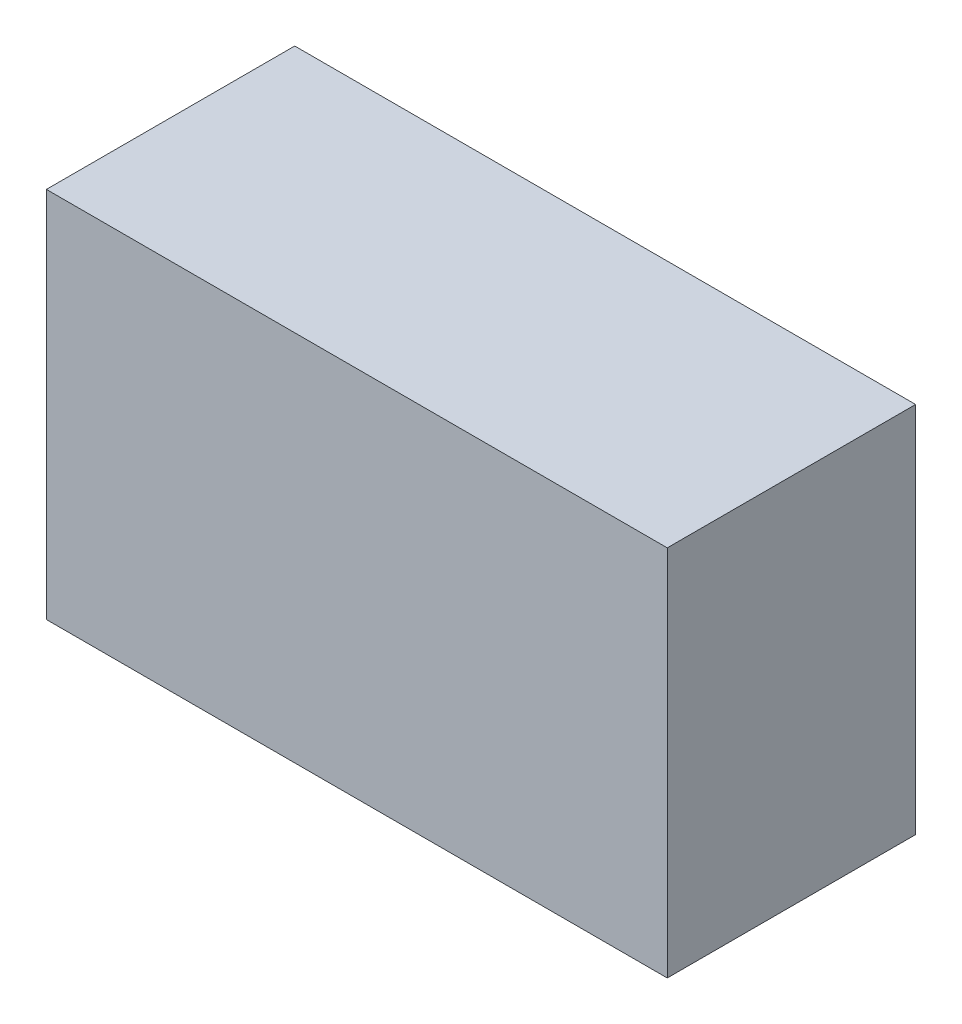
ISO-10303-21;
HEADER;
FILE_DESCRIPTION(('STEP AP214'),'2;1');
FILE_NAME('part.step','',(''),(''),'','','');
FILE_SCHEMA(('AUTOMOTIVE_DESIGN { 1 0 10303 214 1 1 1 1 }'));
ENDSEC;
DATA;
#1=APPLICATION_CONTEXT('core data for automotive mechanical design processes');
#2=APPLICATION_PROTOCOL_DEFINITION('international standard','automotive_design',2000,#1);
#3=PRODUCT_CONTEXT('',#1,'mechanical');
#4=PRODUCT('Part','Part','',(#3));
#5=PRODUCT_RELATED_PRODUCT_CATEGORY('part','',(#4));
#6=PRODUCT_DEFINITION_FORMATION('','',#4);
#7=PRODUCT_DEFINITION_CONTEXT('part definition',#1,'design');
#8=PRODUCT_DEFINITION('design','',#6,#7);
#9=PRODUCT_DEFINITION_SHAPE('','',#8);
#10=(LENGTH_UNIT() NAMED_UNIT(*) SI_UNIT(.MILLI.,.METRE.));
#11=(NAMED_UNIT(*) PLANE_ANGLE_UNIT() SI_UNIT($,.RADIAN.));
#12=(NAMED_UNIT(*) SI_UNIT($,.STERADIAN.) SOLID_ANGLE_UNIT());
#13=UNCERTAINTY_MEASURE_WITH_UNIT(LENGTH_MEASURE(1.E-05),#10,'distance_accuracy_value','');
#14=(GEOMETRIC_REPRESENTATION_CONTEXT(3) GLOBAL_UNCERTAINTY_ASSIGNED_CONTEXT((#13)) GLOBAL_UNIT_ASSIGNED_CONTEXT((#10,
#11,#12)) REPRESENTATION_CONTEXT('',''));
#15=CARTESIAN_POINT('',(0.,0.,0.));
#16=DIRECTION('',(0.,0.,1.));
#17=DIRECTION('',(1.,0.,0.));
#18=AXIS2_PLACEMENT_3D('',#15,#16,#17);
#19=CARTESIAN_POINT('',(63.5000000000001,-19.05,25.4));
#20=DIRECTION('',(0.,1.,0.));
#21=DIRECTION('',(0.,0.,1.));
#22=AXIS2_PLACEMENT_3D('',#19,#20,#21);
#23=PLANE('',#22);
#24=DIRECTION('',(0.,0.,-1.));
#25=VECTOR('',#24,1.);
#26=CARTESIAN_POINT('',(0.,-19.05,25.4));
#27=LINE('',#26,#25);
#28=CARTESIAN_POINT('',(0.,-19.05,25.4));
#29=VERTEX_POINT('',#28);
#30=CARTESIAN_POINT('',(0.,-19.05,0.));
#31=VERTEX_POINT('',#30);
#32=EDGE_CURVE('E115',#29,#31,#27,.T.);
#33=ORIENTED_EDGE('',*,*,#32,.T.);
#34=DIRECTION('',(-1.,0.,0.));
#35=VECTOR('',#34,1.);
#36=CARTESIAN_POINT('',(63.5000000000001,-19.05,0.));
#37=LINE('',#36,#35);
#38=CARTESIAN_POINT('',(63.5000000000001,-19.05,0.));
#39=VERTEX_POINT('',#38);
#40=EDGE_CURVE('E11',#39,#31,#37,.T.);
#41=ORIENTED_EDGE('',*,*,#40,.F.);
#42=DIRECTION('',(0.,0.,-1.));
#43=VECTOR('',#42,1.);
#44=CARTESIAN_POINT('',(63.5000000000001,-19.05,25.4));
#45=LINE('',#44,#43);
#46=CARTESIAN_POINT('',(63.5000000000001,-19.05,25.4));
#47=VERTEX_POINT('',#46);
#48=EDGE_CURVE('E94',#47,#39,#45,.T.);
#49=ORIENTED_EDGE('',*,*,#48,.F.);
#50=DIRECTION('',(-1.,0.,0.));
#51=VECTOR('',#50,1.);
#52=CARTESIAN_POINT('',(63.5000000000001,-19.05,25.4));
#53=LINE('',#52,#51);
#54=EDGE_CURVE('E106',#47,#29,#53,.T.);
#55=ORIENTED_EDGE('',*,*,#54,.T.);
#56=EDGE_LOOP('',(#33,#41,#49,#55));
#57=FACE_BOUND('',#56,.T.);
#58=ADVANCED_FACE('F43',(#57),#23,.F.);
#59=CARTESIAN_POINT('',(63.5000000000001,-19.05,0.));
#60=DIRECTION('',(0.,0.,1.));
#61=DIRECTION('',(1.,0.,0.));
#62=AXIS2_PLACEMENT_3D('',#59,#60,#61);
#63=PLANE('',#62);
#64=DIRECTION('',(0.,1.,0.));
#65=VECTOR('',#64,1.);
#66=CARTESIAN_POINT('',(0.,-19.05,0.));
#67=LINE('',#66,#65);
#68=CARTESIAN_POINT('',(0.,19.05,0.));
#69=VERTEX_POINT('',#68);
#70=EDGE_CURVE('E99',#31,#69,#67,.T.);
#71=ORIENTED_EDGE('',*,*,#70,.T.);
#72=DIRECTION('',(-1.,0.,0.));
#73=VECTOR('',#72,1.);
#74=CARTESIAN_POINT('',(63.5000000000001,19.05,0.));
#75=LINE('',#74,#73);
#76=CARTESIAN_POINT('',(63.5000000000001,19.05,0.));
#77=VERTEX_POINT('',#76);
#78=EDGE_CURVE('E55',#77,#69,#75,.T.);
#79=ORIENTED_EDGE('',*,*,#78,.F.);
#80=DIRECTION('',(0.,1.,0.));
#81=VECTOR('',#80,1.);
#82=CARTESIAN_POINT('',(63.5000000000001,-19.05,0.));
#83=LINE('',#82,#81);
#84=EDGE_CURVE('E89',#39,#77,#83,.T.);
#85=ORIENTED_EDGE('',*,*,#84,.F.);
#86=ORIENTED_EDGE('',*,*,#40,.T.);
#87=EDGE_LOOP('',(#71,#79,#85,#86));
#88=FACE_BOUND('',#87,.T.);
#89=ADVANCED_FACE('F98',(#88),#63,.F.);
#90=CARTESIAN_POINT('',(63.5000000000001,19.05,0.));
#91=DIRECTION('',(0.,-1.,0.));
#92=DIRECTION('',(0.,0.,-1.));
#93=AXIS2_PLACEMENT_3D('',#90,#91,#92);
#94=PLANE('',#93);
#95=DIRECTION('',(0.,0.,1.));
#96=VECTOR('',#95,1.);
#97=CARTESIAN_POINT('',(0.,19.05,0.));
#98=LINE('',#97,#96);
#99=CARTESIAN_POINT('',(0.,19.05,25.4));
#100=VERTEX_POINT('',#99);
#101=EDGE_CURVE('E77',#69,#100,#98,.T.);
#102=ORIENTED_EDGE('',*,*,#101,.T.);
#103=DIRECTION('',(-1.,0.,0.));
#104=VECTOR('',#103,1.);
#105=CARTESIAN_POINT('',(63.5000000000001,19.05,25.4));
#106=LINE('',#105,#104);
#107=CARTESIAN_POINT('',(63.5000000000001,19.05,25.4));
#108=VERTEX_POINT('',#107);
#109=EDGE_CURVE('E105',#108,#100,#106,.T.);
#110=ORIENTED_EDGE('',*,*,#109,.F.);
#111=DIRECTION('',(0.,0.,1.));
#112=VECTOR('',#111,1.);
#113=CARTESIAN_POINT('',(63.5000000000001,19.05,0.));
#114=LINE('',#113,#112);
#115=EDGE_CURVE('E93',#77,#108,#114,.T.);
#116=ORIENTED_EDGE('',*,*,#115,.F.);
#117=ORIENTED_EDGE('',*,*,#78,.T.);
#118=EDGE_LOOP('',(#102,#110,#116,#117));
#119=FACE_BOUND('',#118,.T.);
#120=ADVANCED_FACE('F104',(#119),#94,.F.);
#121=CARTESIAN_POINT('',(63.5000000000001,19.05,25.4));
#122=DIRECTION('',(0.,0.,-1.));
#123=DIRECTION('',(-1.,0.,0.));
#124=AXIS2_PLACEMENT_3D('',#121,#122,#123);
#125=PLANE('',#124);
#126=DIRECTION('',(0.,-1.,0.));
#127=VECTOR('',#126,1.);
#128=CARTESIAN_POINT('',(0.,19.05,25.4));
#129=LINE('',#128,#127);
#130=EDGE_CURVE('E81',#100,#29,#129,.T.);
#131=ORIENTED_EDGE('',*,*,#130,.T.);
#132=ORIENTED_EDGE('',*,*,#54,.F.);
#133=DIRECTION('',(0.,-1.,0.));
#134=VECTOR('',#133,1.);
#135=CARTESIAN_POINT('',(63.5000000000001,19.05,25.4));
#136=LINE('',#135,#134);
#137=EDGE_CURVE('E58',#108,#47,#136,.T.);
#138=ORIENTED_EDGE('',*,*,#137,.F.);
#139=ORIENTED_EDGE('',*,*,#109,.T.);
#140=EDGE_LOOP('',(#131,#132,#138,#139));
#141=FACE_BOUND('',#140,.T.);
#142=ADVANCED_FACE('F128',(#141),#125,.F.);
#143=CARTESIAN_POINT('',(63.5000000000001,0.,0.));
#144=DIRECTION('',(1.,0.,0.));
#145=DIRECTION('',(0.,0.,-1.));
#146=AXIS2_PLACEMENT_3D('',#143,#144,#145);
#147=PLANE('',#146);
#148=ORIENTED_EDGE('',*,*,#48,.T.);
#149=ORIENTED_EDGE('',*,*,#84,.T.);
#150=ORIENTED_EDGE('',*,*,#115,.T.);
#151=ORIENTED_EDGE('',*,*,#137,.T.);
#152=EDGE_LOOP('',(#148,#149,#150,#151));
#153=FACE_BOUND('',#152,.T.);
#154=ADVANCED_FACE('F91',(#153),#147,.T.);
#155=CARTESIAN_POINT('',(0.,0.,0.));
#156=DIRECTION('',(1.,0.,0.));
#157=DIRECTION('',(0.,0.,-1.));
#158=AXIS2_PLACEMENT_3D('',#155,#156,#157);
#159=PLANE('',#158);
#160=ORIENTED_EDGE('',*,*,#32,.F.);
#161=ORIENTED_EDGE('',*,*,#130,.F.);
#162=ORIENTED_EDGE('',*,*,#101,.F.);
#163=ORIENTED_EDGE('',*,*,#70,.F.);
#164=EDGE_LOOP('',(#160,#161,#162,#163));
#165=FACE_BOUND('',#164,.T.);
#166=ADVANCED_FACE('F129',(#165),#159,.F.);
#167=CLOSED_SHELL('',(#58,#89,#120,#142,#154,#166));
#168=MANIFOLD_SOLID_BREP('B2',#167);
#169=ADVANCED_BREP_SHAPE_REPRESENTATION('',(#18,#168),#14);
#170=SHAPE_DEFINITION_REPRESENTATION(#9,#169);
ENDSEC;
END-ISO-10303-21;
